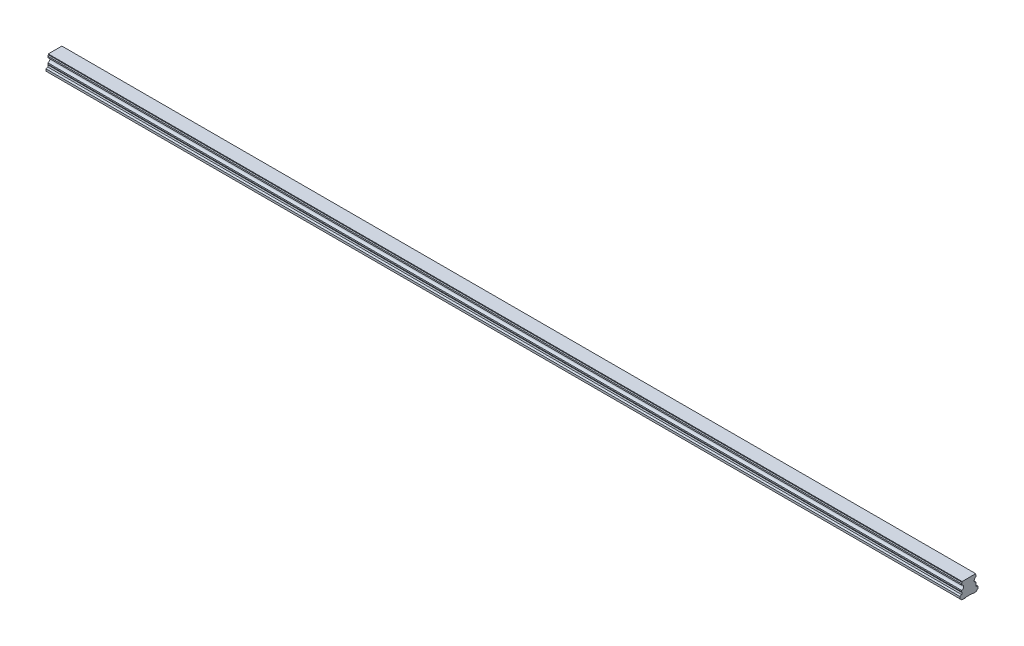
from build123d import *

# Parameters (mm, degrees)
BOSS_EXTRUDE1_DEPTH        = 1260
SKETCH3_R                  = 3
SKETCH3_R_2                = 2.5
CUT_EXTRUDE3_DEPTH         = 12
SKETCH3_2_R                = 2.5
CUT_EXTRUDE4_DEPTH         = 15
CHAMFER1_SIZE              = 0.5
LPATTERN4_COUNT            = 21
LPATTERN4_PITCH            = 60
CHAMFER1_OF_LPATTERN4_SIZE = 0.5


with BuildPart() as part:
    # Sketch1 → Boss-Extrude1 (new body)
    with BuildSketch(Plane(origin=(0, 0, 0), x_dir=(0, 0, -1), z_dir=(1, 0, 0))):
        with BuildLine():
            Line((9.375, 21.8), (-9.375, 21.8))
            Line((-9.375, 21.8), (-9.375, 20.756))
            Line((-9.375, 20.756), (-10, 19.415683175))
            Line((-10, 19.415683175), (-10, 17.685449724))
            ThreePointArc((-10, 17.685449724), (-7.2, 14.6), (-10, 11.514550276))
            Line((-10, 11.514550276), (-10, 9.784316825))
            Line((-10, 9.784316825), (-9.375, 8.444))
            Line((-9.375, 8.444), (-9.922688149, 6.4))
            Line((-9.922688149, 6.4), (-12.5, 5.489338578))
            Line((-12.5, 5.489338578), (-12.5, 2.65))
            Line((-12.5, 2.65), (-9.85, 0))
            Line((-9.85, 0), (-5.5, 0))
            Line((-5.5, 0), (-5, 0.5))
            Line((-5, 0.5), (5, 0.5))
            Line((5, 0.5), (5.5, 0))
            Line((5.5, 0), (9.85, 0))
            Line((9.85, 0), (12.5, 2.65))
            Line((12.5, 2.65), (12.5, 5.489338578))
            Line((12.5, 5.489338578), (9.922688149, 6.4))
            Line((9.922688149, 6.4), (9.375, 8.444))
            Line((9.375, 8.444), (10, 9.784316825))
            Line((10, 9.784316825), (10, 11.514550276))
            ThreePointArc((10, 11.514550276), (7.2, 14.6), (10, 17.685449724))
            Line((10, 17.685449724), (10, 19.415683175))
            Line((10, 19.415683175), (9.375, 20.756))
            Line((9.375, 20.756), (9.375, 21.8))
        make_face()
    extrude(amount=BOSS_EXTRUDE1_DEPTH)

    # Sketch3 → Cut-Extrude3 (cut)
    with BuildSketch(Plane.XZ):
        with Locations(Location((30, 0, 0), (0, 0, 270))):
            Circle(SKETCH3_R)
        with Locations(Location((30, 0, 0), (0, 0, 270))):
            Circle(SKETCH3_R_2, mode=Mode.SUBTRACT)
    cut_extrude3 = extrude(amount=-CUT_EXTRUDE3_DEPTH, mode=Mode.SUBTRACT)

    # Sketch3_2 → Cut-Extrude4 (cut)
    with BuildSketch(Plane.XZ):
        with Locations(Location((30, 0, 0), (0, 0, 270))):
            Circle(SKETCH3_2_R)
    cut_extrude4 = extrude(amount=-CUT_EXTRUDE4_DEPTH, mode=Mode.SUBTRACT)

    # Cut-Extrude5 cone 1 section (on through the dimple's axis) → Cut-Extrude5 (revolve, cut)
    with BuildSketch(Plane(origin=(30, 15, 0), x_dir=(0, 0, -1), z_dir=(1, 0, 0))):
        Polygon((0, 0), (2.5, 0), (0, 1.443375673), align=None)
    cut_extrude5 = revolve(axis=Axis((30, 15, 0), (0, 1, 0)), mode=Mode.SUBTRACT)

    # Chamfer1
    chamfer1_edges = [part.edges().sort_by_distance(p)[0] for p in [
        (30, 0.5, 3),
    ]]
    chamfer(chamfer1_edges, length=CHAMFER1_SIZE)

    # LPattern4: Cut-Extrude3, Cut-Extrude4, Cut-Extrude5 ×21
    with Locations(*[(i * LPATTERN4_PITCH, 0, 0) for i in range(1, LPATTERN4_COUNT)]):
        add(cut_extrude3, mode=Mode.SUBTRACT)
        add(cut_extrude4, mode=Mode.SUBTRACT)
        add(cut_extrude5, mode=Mode.SUBTRACT)

    # Chamfer1 of LPattern4
    chamfer1_of_lpattern4_edges = [part.edges().sort_by_distance(p)[0] for p in [
        (90, 0.5, 3),
        (150, 0.5, 3),
        (210, 0.5, 3),
        (270, 0.5, 3),
        (330, 0.5, 3),
        (390, 0.5, 3),
        (450, 0.5, 3),
        (510, 0.5, 3),
        (570, 0.5, 3),
        (630, 0.5, 3),
        (690, 0.5, 3),
        (750, 0.5, 3),
        (810, 0.5, 3),
        (870, 0.5, 3),
        (930, 0.5, 3),
        (990, 0.5, 3),
        (1050, 0.5, 3),
        (1110, 0.5, 3),
        (1170, 0.5, 3),
        (1230, 0.5, 3),
    ]]
    chamfer(chamfer1_of_lpattern4_edges, length=CHAMFER1_OF_LPATTERN4_SIZE)


solid = part.part
